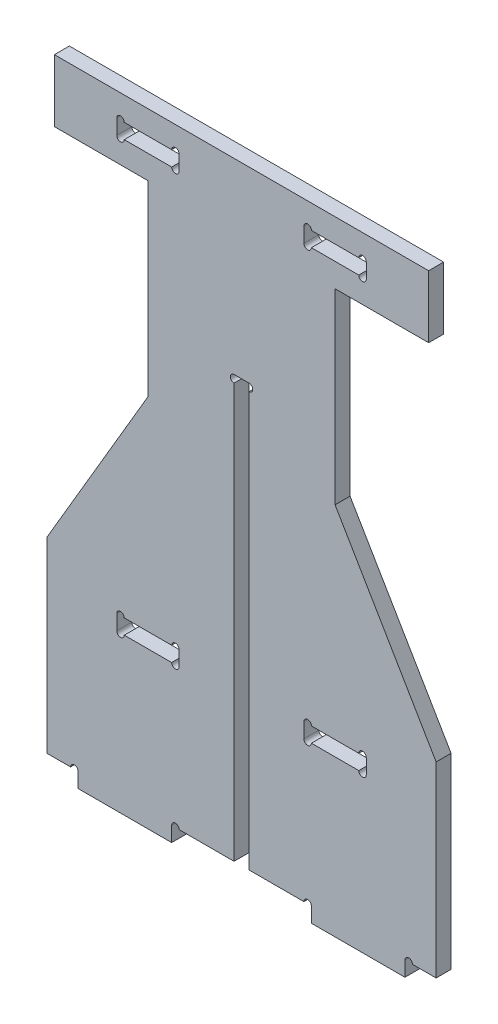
from build123d import *

# Parameters (mm, degrees)
BOSS_EXTRUDE1_DEPTH = 12


with BuildPart() as part:
    # Sketch1 → Boss-Extrude1 (new body)
    with BuildSketch(Plane(origin=(0, 0, 0), x_dir=(1, 0, 0), z_dir=(0, 0, -1))):
        with BuildLine():
            Line((-150, 0), (150, 0))
            Line((150, 0), (150, 50))
            Line((150, 50), (75, 50))
            Line((75, 50), (75, 200))
            Line((75, 200), (156, 338))
            Line((156, 338), (156, 488))
            Line((156, 488), (137, 488))
            ThreePointArc((137, 488), (134, 485), (131, 488))
            Line((131, 488), (131, 500))
            Line((131, 500), (56, 500))
            Line((56, 500), (56, 488))
            ThreePointArc((56, 488), (53, 485), (50, 488))
            Line((50, 488), (6, 488))
            Line((6, 488), (6, 156))
            ThreePointArc((6, 156), (9, 153), (6, 150))
            Line((6, 150), (-6, 150))
            ThreePointArc((-6, 150), (-9, 153), (-6, 156))
            Line((-6, 156), (-6, 488))
            Line((-6, 488), (-50, 488))
            ThreePointArc((-50, 488), (-53, 485), (-56, 488))
            Line((-56, 488), (-56, 500))
            Line((-56, 500), (-131, 500))
            Line((-131, 500), (-131, 488))
            ThreePointArc((-131, 488), (-134, 485), (-137, 488))
            Line((-137, 488), (-156, 488))
            Line((-156, 488), (-156, 338))
            Line((-156, 338), (-75, 200))
            Line((-75, 200), (-75, 50))
            Line((-75, 50), (-150, 50))
            Line((-150, 50), (-150, 0))
        make_face()
        with BuildLine():
            Line((56, 19), (94, 19))
            ThreePointArc((94, 19), (97, 16), (100, 19))
            Line((100, 19), (100, 31))
            ThreePointArc((100, 31), (97, 34), (94, 31))
            Line((94, 31), (56, 31))
            ThreePointArc((56, 31), (53, 34), (50, 31))
            Line((50, 31), (50, 19))
            ThreePointArc((50, 19), (53, 16), (56, 19))
        make_face(mode=Mode.SUBTRACT)
        with BuildLine():
            Line((56, 375), (94, 375))
            ThreePointArc((94, 375), (97, 378), (100, 375))
            Line((100, 375), (100, 363))
            ThreePointArc((100, 363), (97, 360), (94, 363))
            Line((94, 363), (56, 363))
            ThreePointArc((56, 363), (53, 360), (50, 363))
            Line((50, 363), (50, 375))
            ThreePointArc((50, 375), (53, 378), (56, 375))
        make_face(mode=Mode.SUBTRACT)
        with BuildLine():
            Line((-50, 31), (-50, 19))
            ThreePointArc((-50, 19), (-53, 16), (-56, 19))
            Line((-56, 19), (-94, 19))
            ThreePointArc((-94, 19), (-97, 16), (-100, 19))
            Line((-100, 19), (-100, 31))
            ThreePointArc((-100, 31), (-97, 34), (-94, 31))
            Line((-94, 31), (-56, 31))
            ThreePointArc((-56, 31), (-53, 34), (-50, 31))
        make_face(mode=Mode.SUBTRACT)
        with BuildLine():
            Line((-56, 375), (-94, 375))
            ThreePointArc((-94, 375), (-97, 378), (-100, 375))
            Line((-100, 375), (-100, 363))
            ThreePointArc((-100, 363), (-97, 360), (-94, 363))
            Line((-94, 363), (-56, 363))
            ThreePointArc((-56, 363), (-53, 360), (-50, 363))
            Line((-50, 363), (-50, 375))
            ThreePointArc((-50, 375), (-53, 378), (-56, 375))
        make_face(mode=Mode.SUBTRACT)
    extrude(amount=BOSS_EXTRUDE1_DEPTH)


solid = part.part
